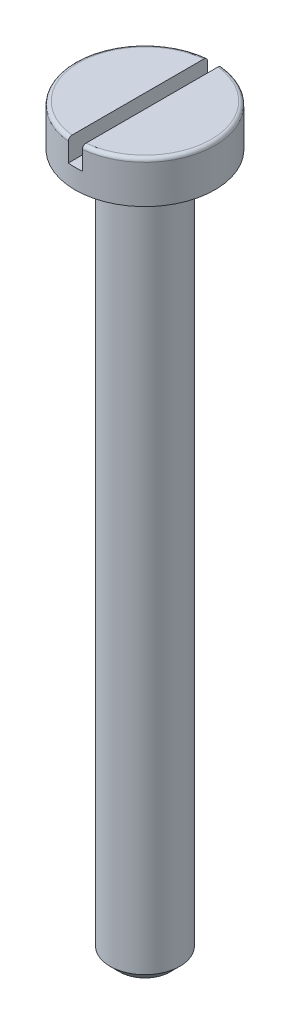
from build123d import *

# Parameters (mm, degrees)
ESQUISSE1_R             = 1.25
BASE_EXTRUSION_DEPTH    = 25
CHANFREIN1_SIZE         = 0.35
ESQUISSE3_W             = 0.5
ESQUISSE3_H             = 5
ENL_V_MAT_EXTRU_1_DEPTH = 0.8


with BuildPart() as part:
    # Esquisse1 → Base-Extrusion (new body)
    with BuildSketch(Plane(origin=(0, 0, 0), x_dir=(1, 0, 0), z_dir=(0, 1, 0))):
        with Locations(Location((0, 0, 0), (0, 0, 270))):
            Circle(ESQUISSE1_R)
    extrude(amount=-BASE_EXTRUSION_DEPTH)

    # Chanfrein1
    chanfrein1_edges = [part.edges().sort_by_distance(p)[0] for p in [
        (0, -25, -1.25),
    ]]
    chamfer(chanfrein1_edges, length=CHANFREIN1_SIZE)

    # Esquisse2 → Boss.-R_vol.1 (revolve)
    with BuildSketch(Plane.XY, mode=Mode.PRIVATE) as boss_r_vol_1_sk:
        with BuildLine():
            Line((0, 1.5), (0, 0))
            Line((0, 0), (2.5, 0))
            Line((2.5, 0), (2.5, 1.37))
            ThreePointArc((2.5, 1.37), (2.461923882, 1.461923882), (2.37, 1.5))
            Line((2.37, 1.5), (0, 1.5))
        make_face()
    revolve(boss_r_vol_1_sk.sketch.rotate(Axis((0, 1.3, 0), (0, -1, 0)), 90), axis=Axis((0, 1.3, 0), (0, -1, 0)))

    # Esquisse3 → Enl_v. mat.-Extru.1 (cut)
    with BuildSketch(Plane(origin=(0, 1.5, 0), x_dir=(-1, 0, 0), z_dir=(0, 1, 0))):
        Rectangle(ESQUISSE3_W, ESQUISSE3_H)
    extrude(amount=-ENL_V_MAT_EXTRU_1_DEPTH, mode=Mode.SUBTRACT)


solid = part.part
